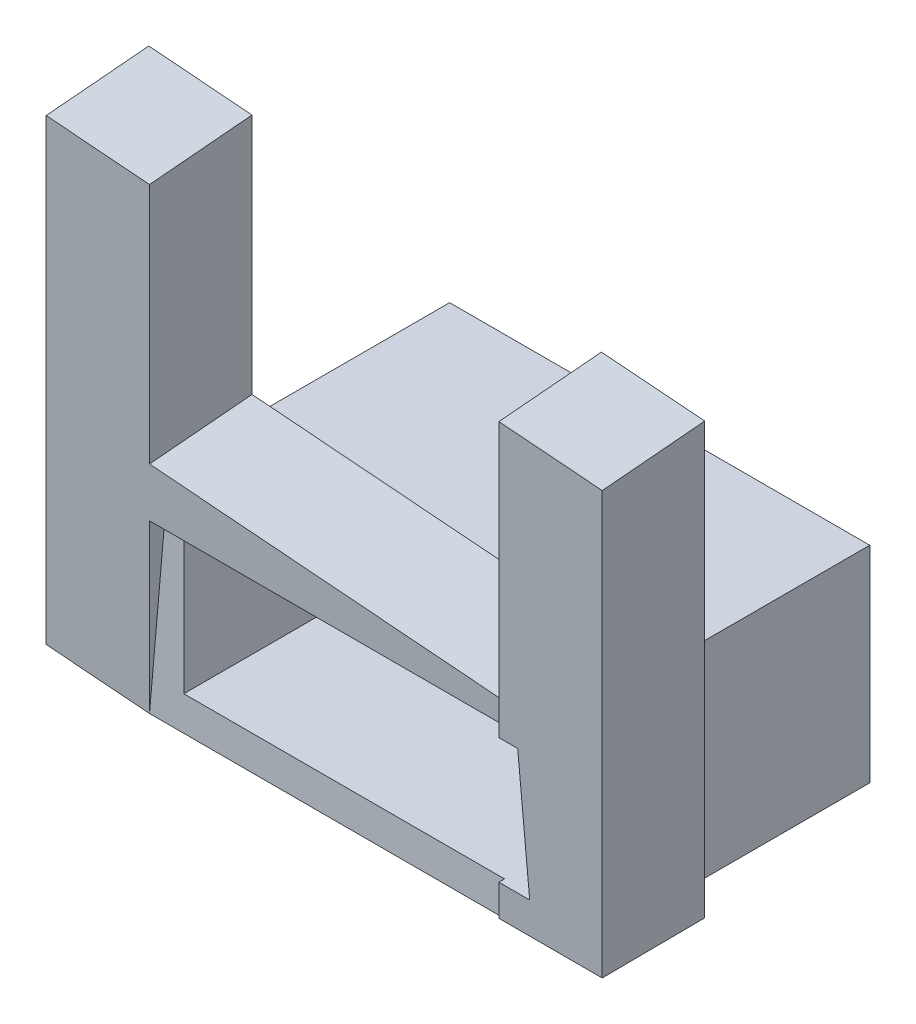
ISO-10303-21;
HEADER;
FILE_DESCRIPTION(('STEP AP214'),'2;1');
FILE_NAME('part.step','',(''),(''),'','','');
FILE_SCHEMA(('AUTOMOTIVE_DESIGN { 1 0 10303 214 1 1 1 1 }'));
ENDSEC;
DATA;
#1=APPLICATION_CONTEXT('core data for automotive mechanical design processes');
#2=APPLICATION_PROTOCOL_DEFINITION('international standard','automotive_design',2000,#1);
#3=PRODUCT_CONTEXT('',#1,'mechanical');
#4=PRODUCT('Part','Part','',(#3));
#5=PRODUCT_RELATED_PRODUCT_CATEGORY('part','',(#4));
#6=PRODUCT_DEFINITION_FORMATION('','',#4);
#7=PRODUCT_DEFINITION_CONTEXT('part definition',#1,'design');
#8=PRODUCT_DEFINITION('design','',#6,#7);
#9=PRODUCT_DEFINITION_SHAPE('','',#8);
#10=(LENGTH_UNIT() NAMED_UNIT(*) SI_UNIT(.MILLI.,.METRE.));
#11=(NAMED_UNIT(*) PLANE_ANGLE_UNIT() SI_UNIT($,.RADIAN.));
#12=(NAMED_UNIT(*) SI_UNIT($,.STERADIAN.) SOLID_ANGLE_UNIT());
#13=UNCERTAINTY_MEASURE_WITH_UNIT(LENGTH_MEASURE(1.E-05),#10,'distance_accuracy_value','');
#14=(GEOMETRIC_REPRESENTATION_CONTEXT(3) GLOBAL_UNCERTAINTY_ASSIGNED_CONTEXT((#13)) GLOBAL_UNIT_ASSIGNED_CONTEXT((#10,
#11,#12)) REPRESENTATION_CONTEXT('',''));
#15=CARTESIAN_POINT('',(0.,0.,0.));
#16=DIRECTION('',(0.,0.,1.));
#17=DIRECTION('',(1.,0.,0.));
#18=AXIS2_PLACEMENT_3D('',#15,#16,#17);
#19=CARTESIAN_POINT('',(-1.85740908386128,22.3757953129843,-10.0882096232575));
#20=DIRECTION('',(0.,-0.996194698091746,-0.0871557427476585));
#21=DIRECTION('',(0.,0.0871557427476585,-0.996194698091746));
#22=AXIS2_PLACEMENT_3D('',#19,#20,#21);
#23=PLANE('',#22);
#24=DIRECTION('',(1.,0.,0.));
#25=VECTOR('',#24,1.);
#26=CARTESIAN_POINT('',(-1.85740908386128,21.4931913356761,0.));
#27=LINE('',#26,#25);
#28=CARTESIAN_POINT('',(1.86612675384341,21.4931913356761,0.));
#29=VERTEX_POINT('',#28);
#30=CARTESIAN_POINT('',(42.9278753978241,21.4931913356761,0.));
#31=VERTEX_POINT('',#30);
#32=EDGE_CURVE('E344',#29,#31,#27,.T.);
#33=ORIENTED_EDGE('',*,*,#32,.T.);
#34=DIRECTION('',(0.,-0.0871557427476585,0.996194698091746));
#35=VECTOR('',#34,1.);
#36=CARTESIAN_POINT('',(42.9278753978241,22.3757953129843,-10.0882096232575));
#37=LINE('',#36,#35);
#38=CARTESIAN_POINT('',(42.9278753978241,21.3299264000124,1.86612675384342));
#39=VERTEX_POINT('',#38);
#40=EDGE_CURVE('E282',#31,#39,#37,.T.);
#41=ORIENTED_EDGE('',*,*,#40,.T.);
#42=DIRECTION('',(1.,0.,0.));
#43=VECTOR('',#42,1.);
#44=CARTESIAN_POINT('',(-1.85740908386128,21.3299264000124,1.86612675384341));
#45=LINE('',#44,#43);
#46=CARTESIAN_POINT('',(1.86612675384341,21.3299264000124,1.86612675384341));
#47=VERTEX_POINT('',#46);
#48=EDGE_CURVE('E348',#47,#39,#45,.T.);
#49=ORIENTED_EDGE('',*,*,#48,.F.);
#50=DIRECTION('',(0.,-0.0871557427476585,0.996194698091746));
#51=VECTOR('',#50,1.);
#52=CARTESIAN_POINT('',(1.86612675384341,21.3299264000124,1.86612675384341));
#53=LINE('',#52,#51);
#54=EDGE_CURVE('E364',#29,#47,#53,.T.);
#55=ORIENTED_EDGE('',*,*,#54,.F.);
#56=EDGE_LOOP('',(#33,#41,#49,#55));
#57=FACE_BOUND('',#56,.T.);
#58=ADVANCED_FACE('F67',(#57),#23,.T.);
#59=CARTESIAN_POINT('',(44.3444251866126,22.3757953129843,-10.0882096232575));
#60=DIRECTION('',(0.904828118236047,0.424156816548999,0.0371089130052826));
#61=DIRECTION('',(-0.424449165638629,0.905451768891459,0.));
#62=AXIS2_PLACEMENT_3D('',#59,#60,#61);
#63=PLANE('',#62);
#64=DIRECTION('',(0.,0.0871557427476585,-0.996194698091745));
#65=VECTOR('',#64,1.);
#66=CARTESIAN_POINT('',(43.1492429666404,24.9060382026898,-9.86684205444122));
#67=LINE('',#66,#65);
#68=CARTESIAN_POINT('',(43.1492429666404,23.8601692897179,2.08749432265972));
#69=VERTEX_POINT('',#68);
#70=CARTESIAN_POINT('',(43.1492429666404,24.8789553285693,-9.55728338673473));
#71=VERTEX_POINT('',#70);
#72=EDGE_CURVE('E286',#69,#71,#67,.T.);
#73=ORIENTED_EDGE('',*,*,#72,.T.);
#74=DIRECTION('',(0.425777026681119,-0.901384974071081,-0.0788609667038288));
#75=VECTOR('',#74,1.);
#76=CARTESIAN_POINT('',(44.3444251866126,22.3487124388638,-9.77865095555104));
#77=LINE('',#76,#75);
#78=CARTESIAN_POINT('',(43.5644251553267,24.,-9.63418201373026));
#79=VERTEX_POINT('',#78);
#80=EDGE_CURVE('E276',#71,#79,#77,.T.);
#81=ORIENTED_EDGE('',*,*,#80,.T.);
#82=DIRECTION('',(0.040977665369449,0.,-0.99916006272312));
#83=VECTOR('',#82,1.);
#84=CARTESIAN_POINT('',(43.5843242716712,24.,-10.1193829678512));
#85=LINE('',#84,#83);
#86=CARTESIAN_POINT('',(43.577217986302,24.,-9.94611012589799));
#87=VERTEX_POINT('',#86);
#88=EDGE_CURVE('E73',#79,#87,#85,.T.);
#89=ORIENTED_EDGE('',*,*,#88,.T.);
#90=DIRECTION('',(-0.425777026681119,0.901384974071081,0.0788609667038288));
#91=VECTOR('',#90,1.);
#92=CARTESIAN_POINT('',(44.3444251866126,22.3757953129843,-10.0882096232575));
#93=LINE('',#92,#91);
#94=CARTESIAN_POINT('',(43.0456461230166,25.1253563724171,-9.84765420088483));
#95=VERTEX_POINT('',#94);
#96=EDGE_CURVE('E352',#87,#95,#93,.T.);
#97=ORIENTED_EDGE('',*,*,#96,.T.);
#98=DIRECTION('',(0.,-0.0871557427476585,0.996194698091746));
#99=VECTOR('',#98,1.);
#100=CARTESIAN_POINT('',(43.0456461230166,25.1253563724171,-9.84765420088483));
#101=LINE('',#100,#99);
#102=CARTESIAN_POINT('',(43.0456461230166,24.0794874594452,2.10668217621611));
#103=VERTEX_POINT('',#102);
#104=EDGE_CURVE('E356',#95,#103,#101,.T.);
#105=ORIENTED_EDGE('',*,*,#104,.T.);
#106=DIRECTION('',(-0.425777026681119,0.901384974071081,0.0788609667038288));
#107=VECTOR('',#106,1.);
#108=CARTESIAN_POINT('',(44.3444251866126,21.3299264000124,1.86612675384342));
#109=LINE('',#108,#107);
#110=EDGE_CURVE('E358',#69,#103,#109,.T.);
#111=ORIENTED_EDGE('',*,*,#110,.F.);
#112=EDGE_LOOP('',(#73,#81,#89,#97,#105,#111));
#113=FACE_BOUND('',#112,.T.);
#114=ADVANCED_FACE('F451',(#113),#63,.T.);
#115=CARTESIAN_POINT('',(-6.83191224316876,59.5914723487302,5.21357827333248));
#116=DIRECTION('',(0.,0.0871557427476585,-0.996194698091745));
#117=DIRECTION('',(0.,0.996194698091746,0.0871557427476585));
#118=AXIS2_PLACEMENT_3D('',#115,#116,#117);
#119=PLANE('',#118);
#120=DIRECTION('',(-0.0868265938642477,-0.992432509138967,-0.0868265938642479));
#121=VECTOR('',#120,1.);
#122=CARTESIAN_POINT('',(45.8749590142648,55.0152462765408,4.81321037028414));
#123=LINE('',#122,#121);
#124=EDGE_CURVE('E281',#69,#39,#123,.T.);
#125=ORIENTED_EDGE('',*,*,#124,.F.);
#126=ORIENTED_EDGE('',*,*,#110,.T.);
#127=DIRECTION('',(-0.996194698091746,0.0868240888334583,0.00759612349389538));
#128=VECTOR('',#127,1.);
#129=CARTESIAN_POINT('',(43.0456461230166,24.0794874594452,2.10668217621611));
#130=LINE('',#129,#128);
#131=CARTESIAN_POINT('',(2.41648519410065,27.6205521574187,2.41648519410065));
#132=VERTEX_POINT('',#131);
#133=EDGE_CURVE('E351',#103,#132,#130,.T.);
#134=ORIENTED_EDGE('',*,*,#133,.T.);
#135=DIRECTION('',(-0.0868265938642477,-0.992432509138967,-0.0868265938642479));
#136=VECTOR('',#135,1.);
#137=CARTESIAN_POINT('',(5.12276903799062,58.5535180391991,5.12276903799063));
#138=LINE('',#137,#136);
#139=CARTESIAN_POINT('',(5.12276903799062,58.5535180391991,5.12276903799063));
#140=VERTEX_POINT('',#139);
#141=EDGE_CURVE('E399',#140,#132,#138,.T.);
#142=ORIENTED_EDGE('',*,*,#141,.F.);
#143=DIRECTION('',(0.996223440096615,-0.0864961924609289,-0.00756743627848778));
#144=VECTOR('',#143,1.);
#145=CARTESIAN_POINT('',(-6.83191224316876,59.5914723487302,5.21357827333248));
#146=LINE('',#145,#144);
#147=CARTESIAN_POINT('',(-6.83191224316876,59.5914723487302,5.21357827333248));
#148=VERTEX_POINT('',#147);
#149=EDGE_CURVE('E371',#148,#140,#146,.T.);
#150=ORIENTED_EDGE('',*,*,#149,.F.);
#151=DIRECTION('',(-0.0868265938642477,-0.992432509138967,-0.0868265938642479));
#152=VECTOR('',#151,1.);
#153=CARTESIAN_POINT('',(-6.83191224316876,59.5914723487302,5.21357827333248));
#154=LINE('',#153,#152);
#155=CARTESIAN_POINT('',(-11.9546812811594,1.03795430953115,0.0908092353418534));
#156=VERTEX_POINT('',#155);
#157=EDGE_CURVE('E381',#148,#156,#154,.T.);
#158=ORIENTED_EDGE('',*,*,#157,.T.);
#159=DIRECTION('',(0.996223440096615,-0.0864961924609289,-0.00756743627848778));
#160=VECTOR('',#159,1.);
#161=CARTESIAN_POINT('',(-11.9546812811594,1.03795430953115,0.0908092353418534));
#162=LINE('',#161,#160);
#163=CARTESIAN_POINT('',(0.,0.,0.));
#164=VERTEX_POINT('',#163);
#165=EDGE_CURVE('E367',#156,#164,#162,.T.);
#166=ORIENTED_EDGE('',*,*,#165,.T.);
#167=EDGE_CURVE('E397',#47,#164,#138,.T.);
#168=ORIENTED_EDGE('',*,*,#167,.F.);
#169=ORIENTED_EDGE('',*,*,#48,.T.);
#170=EDGE_LOOP('',(#125,#126,#134,#142,#150,#158,#166,#168,#169));
#171=FACE_BOUND('',#170,.T.);
#172=ADVANCED_FACE('F68',(#171),#119,.F.);
#173=CARTESIAN_POINT('',(0.,0.,0.));
#174=DIRECTION('',(0.,0.,-1.));
#175=DIRECTION('',(-1.,0.,0.));
#176=AXIS2_PLACEMENT_3D('',#173,#174,#175);
#177=PLANE('',#176);
#178=DIRECTION('',(-0.0864986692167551,-0.996251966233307,0.));
#179=VECTOR('',#178,1.);
#180=CARTESIAN_POINT('',(40.7545238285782,-3.53847439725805,0.));
#181=LINE('',#180,#179);
#182=CARTESIAN_POINT('',(42.79823042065,20.,0.));
#183=VERTEX_POINT('',#182);
#184=EDGE_CURVE('E12',#31,#183,#181,.T.);
#185=ORIENTED_EDGE('',*,*,#184,.F.);
#186=ORIENTED_EDGE('',*,*,#32,.F.);
#187=DIRECTION('',(-0.0864986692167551,-0.996251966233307,0.));
#188=VECTOR('',#187,1.);
#189=CARTESIAN_POINT('',(5.08414700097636,58.5568713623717,0.));
#190=LINE('',#189,#188);
#191=EDGE_CURVE('E347',#29,#164,#190,.T.);
#192=ORIENTED_EDGE('',*,*,#191,.T.);
#193=DIRECTION('',(1.,0.,0.));
#194=VECTOR('',#193,1.);
#195=CARTESIAN_POINT('',(0.,0.,0.));
#196=LINE('',#195,#194);
#197=CARTESIAN_POINT('',(41.0617486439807,0.,0.));
#198=VERTEX_POINT('',#197);
#199=EDGE_CURVE('E318',#164,#198,#196,.T.);
#200=ORIENTED_EDGE('',*,*,#199,.T.);
#201=DIRECTION('',(-0.0864986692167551,-0.996251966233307,0.));
#202=VECTOR('',#201,1.);
#203=CARTESIAN_POINT('',(40.7545238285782,-3.53847439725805,0.));
#204=LINE('',#203,#202);
#205=CARTESIAN_POINT('',(41.4090449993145,4.,0.));
#206=VERTEX_POINT('',#205);
#207=EDGE_CURVE('E272',#206,#198,#204,.T.);
#208=ORIENTED_EDGE('',*,*,#207,.F.);
#209=DIRECTION('',(1.,0.,0.));
#210=VECTOR('',#209,1.);
#211=CARTESIAN_POINT('',(4.,4.,0.));
#212=LINE('',#211,#210);
#213=CARTESIAN_POINT('',(4.,4.,0.));
#214=VERTEX_POINT('',#213);
#215=EDGE_CURVE('E291',#214,#206,#212,.T.);
#216=ORIENTED_EDGE('',*,*,#215,.F.);
#217=DIRECTION('',(0.,1.,0.));
#218=VECTOR('',#217,1.);
#219=CARTESIAN_POINT('',(4.,4.,0.));
#220=LINE('',#219,#218);
#221=CARTESIAN_POINT('',(4.,20.,0.));
#222=VERTEX_POINT('',#221);
#223=EDGE_CURVE('E288',#214,#222,#220,.T.);
#224=ORIENTED_EDGE('',*,*,#223,.T.);
#225=DIRECTION('',(1.,0.,0.));
#226=VECTOR('',#225,1.);
#227=CARTESIAN_POINT('',(4.,20.,0.));
#228=LINE('',#227,#226);
#229=EDGE_CURVE('E303',#222,#183,#228,.T.);
#230=ORIENTED_EDGE('',*,*,#229,.T.);
#231=EDGE_LOOP('',(#185,#186,#192,#200,#208,#216,#224,#230));
#232=FACE_BOUND('',#231,.T.);
#233=ADVANCED_FACE('F447',(#232),#177,.F.);
#234=CARTESIAN_POINT('',(0.,24.,-35.));
#235=DIRECTION('',(0.,-1.,0.));
#236=DIRECTION('',(0.,0.,-1.));
#237=AXIS2_PLACEMENT_3D('',#234,#235,#236);
#238=PLANE('',#237);
#239=DIRECTION('',(-1.,0.,0.));
#240=VECTOR('',#239,1.);
#241=CARTESIAN_POINT('',(0.,24.,-9.63418201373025));
#242=LINE('',#241,#240);
#243=CARTESIAN_POINT('',(49.,24.,-9.63418201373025));
#244=VERTEX_POINT('',#243);
#245=EDGE_CURVE('E280',#244,#79,#242,.T.);
#246=ORIENTED_EDGE('',*,*,#245,.F.);
#247=DIRECTION('',(0.,0.,1.));
#248=VECTOR('',#247,1.);
#249=CARTESIAN_POINT('',(49.,24.,-35.));
#250=LINE('',#249,#248);
#251=CARTESIAN_POINT('',(49.,24.,-35.));
#252=VERTEX_POINT('',#251);
#253=EDGE_CURVE('E333',#252,#244,#250,.T.);
#254=ORIENTED_EDGE('',*,*,#253,.F.);
#255=DIRECTION('',(1.,0.,0.));
#256=VECTOR('',#255,1.);
#257=CARTESIAN_POINT('',(0.,24.,-35.));
#258=LINE('',#257,#256);
#259=CARTESIAN_POINT('',(0.,24.,-35.));
#260=VERTEX_POINT('',#259);
#261=EDGE_CURVE('E325',#260,#252,#258,.T.);
#262=ORIENTED_EDGE('',*,*,#261,.F.);
#263=DIRECTION('',(0.,0.,1.));
#264=VECTOR('',#263,1.);
#265=CARTESIAN_POINT('',(0.,24.,-35.));
#266=LINE('',#265,#264);
#267=CARTESIAN_POINT('',(0.,24.,-9.94611012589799));
#268=VERTEX_POINT('',#267);
#269=EDGE_CURVE('E339',#260,#268,#266,.T.);
#270=ORIENTED_EDGE('',*,*,#269,.T.);
#271=DIRECTION('',(1.,0.,0.));
#272=VECTOR('',#271,1.);
#273=CARTESIAN_POINT('',(5.12276903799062,24.,-9.94611012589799));
#274=LINE('',#273,#272);
#275=EDGE_CURVE('E341',#268,#87,#274,.T.);
#276=ORIENTED_EDGE('',*,*,#275,.T.);
#277=ORIENTED_EDGE('',*,*,#88,.F.);
#278=EDGE_LOOP('',(#246,#254,#262,#270,#276,#277));
#279=FACE_BOUND('',#278,.T.);
#280=ADVANCED_FACE('F434',(#279),#238,.F.);
#281=CARTESIAN_POINT('',(49.,0.,-35.));
#282=DIRECTION('',(1.,0.,0.));
#283=DIRECTION('',(0.,0.,-1.));
#284=AXIS2_PLACEMENT_3D('',#281,#282,#283);
#285=PLANE('',#284);
#286=ORIENTED_EDGE('',*,*,#253,.T.);
#287=DIRECTION('',(0.,-0.996194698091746,-0.0871557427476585));
#288=VECTOR('',#287,1.);
#289=CARTESIAN_POINT('',(49.,-2.0200570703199,-11.9106420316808));
#290=LINE('',#289,#288);
#291=CARTESIAN_POINT('',(49.,0.,-11.7339099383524));
#292=VERTEX_POINT('',#291);
#293=EDGE_CURVE('E274',#244,#292,#290,.T.);
#294=ORIENTED_EDGE('',*,*,#293,.T.);
#295=DIRECTION('',(0.,0.,1.));
#296=VECTOR('',#295,1.);
#297=CARTESIAN_POINT('',(49.,0.,-35.));
#298=LINE('',#297,#296);
#299=CARTESIAN_POINT('',(49.,0.,-35.));
#300=VERTEX_POINT('',#299);
#301=EDGE_CURVE('E228',#300,#292,#298,.T.);
#302=ORIENTED_EDGE('',*,*,#301,.F.);
#303=DIRECTION('',(0.,1.,0.));
#304=VECTOR('',#303,1.);
#305=CARTESIAN_POINT('',(49.,0.,-35.));
#306=LINE('',#305,#304);
#307=EDGE_CURVE('E322',#300,#252,#306,.T.);
#308=ORIENTED_EDGE('',*,*,#307,.T.);
#309=EDGE_LOOP('',(#286,#294,#302,#308));
#310=FACE_BOUND('',#309,.T.);
#311=ADVANCED_FACE('F485',(#310),#285,.T.);
#312=CARTESIAN_POINT('',(5.12276903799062,58.5535180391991,5.12276903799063));
#313=DIRECTION('',(-0.996223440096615,0.0864961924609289,0.00756743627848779));
#314=DIRECTION('',(-0.0864986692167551,-0.996251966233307,0.));
#315=AXIS2_PLACEMENT_3D('',#312,#313,#314);
#316=PLANE('',#315);
#317=ORIENTED_EDGE('',*,*,#191,.F.);
#318=ORIENTED_EDGE('',*,*,#54,.T.);
#319=ORIENTED_EDGE('',*,*,#167,.T.);
#320=EDGE_LOOP('',(#317,#318,#319));
#321=FACE_BOUND('',#320,.T.);
#322=ADVANCED_FACE('F410',(#321),#316,.F.);
#323=CARTESIAN_POINT('',(5.12276903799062,59.599386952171,-6.83156733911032));
#324=DIRECTION('',(0.,-0.0871557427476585,0.996194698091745));
#325=DIRECTION('',(0.,-0.996194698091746,-0.0871557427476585));
#326=AXIS2_PLACEMENT_3D('',#323,#324,#325);
#327=PLANE('',#326);
#328=DIRECTION('',(0.,0.996194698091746,0.0871557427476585));
#329=VECTOR('',#328,1.);
#330=CARTESIAN_POINT('',(0.,59.599386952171,-6.83156733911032));
#331=LINE('',#330,#329);
#332=CARTESIAN_POINT('',(0.,1.0458689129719,-11.9543363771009));
#333=VERTEX_POINT('',#332);
#334=EDGE_CURVE('E346',#333,#268,#331,.T.);
#335=ORIENTED_EDGE('',*,*,#334,.F.);
#336=DIRECTION('',(-0.996223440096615,0.0864961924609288,0.00756743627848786));
#337=VECTOR('',#336,1.);
#338=CARTESIAN_POINT('',(0.,1.0458689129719,-11.9543363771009));
#339=LINE('',#338,#337);
#340=CARTESIAN_POINT('',(-11.9546812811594,2.08382322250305,-11.8635271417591));
#341=VERTEX_POINT('',#340);
#342=EDGE_CURVE('E387',#333,#341,#339,.T.);
#343=ORIENTED_EDGE('',*,*,#342,.T.);
#344=DIRECTION('',(-0.0868265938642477,-0.992432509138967,-0.0868265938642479));
#345=VECTOR('',#344,1.);
#346=CARTESIAN_POINT('',(-6.83191224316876,60.6373412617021,-6.74075810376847));
#347=LINE('',#346,#345);
#348=CARTESIAN_POINT('',(-6.83191224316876,60.6373412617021,-6.74075810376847));
#349=VERTEX_POINT('',#348);
#350=EDGE_CURVE('E392',#349,#341,#347,.T.);
#351=ORIENTED_EDGE('',*,*,#350,.F.);
#352=DIRECTION('',(-0.996223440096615,0.0864961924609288,0.00756743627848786));
#353=VECTOR('',#352,1.);
#354=CARTESIAN_POINT('',(5.12276903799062,59.599386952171,-6.83156733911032));
#355=LINE('',#354,#353);
#356=CARTESIAN_POINT('',(5.12276903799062,59.599386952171,-6.83156733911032));
#357=VERTEX_POINT('',#356);
#358=EDGE_CURVE('E380',#357,#349,#355,.T.);
#359=ORIENTED_EDGE('',*,*,#358,.F.);
#360=DIRECTION('',(-0.0868265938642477,-0.992432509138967,-0.0868265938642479));
#361=VECTOR('',#360,1.);
#362=CARTESIAN_POINT('',(5.12276903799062,59.599386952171,-6.83156733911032));
#363=LINE('',#362,#361);
#364=CARTESIAN_POINT('',(2.41648519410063,28.6664210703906,-9.5378511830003));
#365=VERTEX_POINT('',#364);
#366=EDGE_CURVE('E391',#357,#365,#363,.T.);
#367=ORIENTED_EDGE('',*,*,#366,.T.);
#368=DIRECTION('',(-0.996194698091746,0.0868240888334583,0.00759612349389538));
#369=VECTOR('',#368,1.);
#370=CARTESIAN_POINT('',(43.0456461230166,25.1253563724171,-9.84765420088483));
#371=LINE('',#370,#369);
#372=EDGE_CURVE('E354',#95,#365,#371,.T.);
#373=ORIENTED_EDGE('',*,*,#372,.F.);
#374=ORIENTED_EDGE('',*,*,#96,.F.);
#375=ORIENTED_EDGE('',*,*,#275,.F.);
#376=EDGE_LOOP('',(#335,#343,#351,#359,#367,#373,#374,#375));
#377=FACE_BOUND('',#376,.T.);
#378=ADVANCED_FACE('F430',(#377),#327,.F.);
#379=ORIENTED_EDGE('',*,*,#141,.T.);
#380=DIRECTION('',(0.,0.0871557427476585,-0.996194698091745));
#381=VECTOR('',#380,1.);
#382=CARTESIAN_POINT('',(2.41648519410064,27.6205521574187,2.41648519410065));
#383=LINE('',#382,#381);
#384=EDGE_CURVE('E370',#132,#365,#383,.T.);
#385=ORIENTED_EDGE('',*,*,#384,.T.);
#386=ORIENTED_EDGE('',*,*,#366,.F.);
#387=DIRECTION('',(0.,0.0871557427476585,-0.996194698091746));
#388=VECTOR('',#387,1.);
#389=CARTESIAN_POINT('',(5.12276903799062,58.5535180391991,5.12276903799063));
#390=LINE('',#389,#388);
#391=EDGE_CURVE('E372',#140,#357,#390,.T.);
#392=ORIENTED_EDGE('',*,*,#391,.F.);
#393=EDGE_LOOP('',(#379,#385,#386,#392));
#394=FACE_BOUND('',#393,.T.);
#395=ADVANCED_FACE('F456',(#394),#316,.F.);
#396=CARTESIAN_POINT('',(-6.83191224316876,60.6373412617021,-6.74075810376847));
#397=DIRECTION('',(0.996223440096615,-0.0864961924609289,-0.0075674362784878));
#398=DIRECTION('',(0.0864986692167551,0.996251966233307,0.));
#399=AXIS2_PLACEMENT_3D('',#396,#397,#398);
#400=PLANE('',#399);
#401=DIRECTION('',(0.,-0.0871557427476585,0.996194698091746));
#402=VECTOR('',#401,1.);
#403=CARTESIAN_POINT('',(-11.9546812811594,2.08382322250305,-11.8635271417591));
#404=LINE('',#403,#402);
#405=EDGE_CURVE('E374',#341,#156,#404,.T.);
#406=ORIENTED_EDGE('',*,*,#405,.T.);
#407=ORIENTED_EDGE('',*,*,#157,.F.);
#408=DIRECTION('',(0.,-0.0871557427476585,0.996194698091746));
#409=VECTOR('',#408,1.);
#410=CARTESIAN_POINT('',(-6.83191224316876,60.6373412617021,-6.74075810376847));
#411=LINE('',#410,#409);
#412=EDGE_CURVE('E377',#349,#148,#411,.T.);
#413=ORIENTED_EDGE('',*,*,#412,.F.);
#414=ORIENTED_EDGE('',*,*,#350,.T.);
#415=EDGE_LOOP('',(#406,#407,#413,#414));
#416=FACE_BOUND('',#415,.T.);
#417=ADVANCED_FACE('F421',(#416),#400,.F.);
#418=CARTESIAN_POINT('',(5.12276903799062,58.5535180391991,5.12276903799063));
#419=DIRECTION('',(0.0868265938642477,0.992432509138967,0.0868265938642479));
#420=DIRECTION('',(0.,-0.0871557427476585,0.996194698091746));
#421=AXIS2_PLACEMENT_3D('',#418,#419,#420);
#422=PLANE('',#421);
#423=ORIENTED_EDGE('',*,*,#149,.T.);
#424=ORIENTED_EDGE('',*,*,#391,.T.);
#425=ORIENTED_EDGE('',*,*,#358,.T.);
#426=ORIENTED_EDGE('',*,*,#412,.T.);
#427=EDGE_LOOP('',(#423,#424,#425,#426));
#428=FACE_BOUND('',#427,.T.);
#429=ADVANCED_FACE('F458',(#428),#422,.T.);
#430=CARTESIAN_POINT('',(0.,0.,0.));
#431=DIRECTION('',(0.0868265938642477,0.992432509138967,0.0868265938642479));
#432=DIRECTION('',(0.,-0.0871557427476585,0.996194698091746));
#433=AXIS2_PLACEMENT_3D('',#430,#431,#432);
#434=PLANE('',#433);
#435=ORIENTED_EDGE('',*,*,#165,.F.);
#436=ORIENTED_EDGE('',*,*,#405,.F.);
#437=ORIENTED_EDGE('',*,*,#342,.F.);
#438=DIRECTION('',(0.,0.0871557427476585,-0.996194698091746));
#439=VECTOR('',#438,1.);
#440=CARTESIAN_POINT('',(0.,0.,0.));
#441=LINE('',#440,#439);
#442=EDGE_CURVE('E383',#164,#333,#441,.T.);
#443=ORIENTED_EDGE('',*,*,#442,.F.);
#444=EDGE_LOOP('',(#435,#436,#437,#443));
#445=FACE_BOUND('',#444,.T.);
#446=ADVANCED_FACE('F413',(#445),#434,.F.);
#447=CARTESIAN_POINT('',(43.0456461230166,25.1253563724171,-9.84765420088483));
#448=DIRECTION('',(0.0871557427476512,0.992403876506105,0.0868240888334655));
#449=DIRECTION('',(-0.996165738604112,0.0874861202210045,0.));
#450=AXIS2_PLACEMENT_3D('',#447,#448,#449);
#451=PLANE('',#450);
#452=ORIENTED_EDGE('',*,*,#384,.F.);
#453=ORIENTED_EDGE('',*,*,#133,.F.);
#454=ORIENTED_EDGE('',*,*,#104,.F.);
#455=ORIENTED_EDGE('',*,*,#372,.T.);
#456=EDGE_LOOP('',(#452,#453,#454,#455));
#457=FACE_BOUND('',#456,.T.);
#458=ADVANCED_FACE('F457',(#457),#451,.T.);
#459=CARTESIAN_POINT('',(0.,0.,-35.));
#460=DIRECTION('',(1.,0.,0.));
#461=DIRECTION('',(0.,0.,-1.));
#462=AXIS2_PLACEMENT_3D('',#459,#460,#461);
#463=PLANE('',#462);
#464=ORIENTED_EDGE('',*,*,#442,.T.);
#465=ORIENTED_EDGE('',*,*,#334,.T.);
#466=ORIENTED_EDGE('',*,*,#269,.F.);
#467=DIRECTION('',(0.,1.,0.));
#468=VECTOR('',#467,1.);
#469=CARTESIAN_POINT('',(0.,0.,-35.));
#470=LINE('',#469,#468);
#471=CARTESIAN_POINT('',(0.,0.,-35.));
#472=VERTEX_POINT('',#471);
#473=EDGE_CURVE('E317',#472,#260,#470,.T.);
#474=ORIENTED_EDGE('',*,*,#473,.F.);
#475=DIRECTION('',(0.,0.,1.));
#476=VECTOR('',#475,1.);
#477=CARTESIAN_POINT('',(0.,0.,-35.));
#478=LINE('',#477,#476);
#479=EDGE_CURVE('E328',#472,#164,#478,.T.);
#480=ORIENTED_EDGE('',*,*,#479,.T.);
#481=EDGE_LOOP('',(#464,#465,#466,#474,#480));
#482=FACE_BOUND('',#481,.T.);
#483=ADVANCED_FACE('F431',(#482),#463,.F.);
#484=CARTESIAN_POINT('',(0.,0.,-35.));
#485=DIRECTION('',(0.,0.,-1.));
#486=DIRECTION('',(-1.,0.,0.));
#487=AXIS2_PLACEMENT_3D('',#484,#485,#486);
#488=PLANE('',#487);
#489=ORIENTED_EDGE('',*,*,#473,.T.);
#490=ORIENTED_EDGE('',*,*,#261,.T.);
#491=ORIENTED_EDGE('',*,*,#307,.F.);
#492=DIRECTION('',(1.,0.,0.));
#493=VECTOR('',#492,1.);
#494=CARTESIAN_POINT('',(0.,0.,-35.));
#495=LINE('',#494,#493);
#496=EDGE_CURVE('E330',#472,#300,#495,.T.);
#497=ORIENTED_EDGE('',*,*,#496,.F.);
#498=EDGE_LOOP('',(#489,#490,#491,#497));
#499=FACE_BOUND('',#498,.T.);
#500=DIRECTION('',(1.,0.,0.));
#501=VECTOR('',#500,1.);
#502=CARTESIAN_POINT('',(4.,20.,-35.));
#503=LINE('',#502,#501);
#504=CARTESIAN_POINT('',(4.,20.,-35.));
#505=VERTEX_POINT('',#504);
#506=CARTESIAN_POINT('',(45.,20.,-35.));
#507=VERTEX_POINT('',#506);
#508=EDGE_CURVE('E295',#505,#507,#503,.T.);
#509=ORIENTED_EDGE('',*,*,#508,.F.);
#510=DIRECTION('',(0.,1.,0.));
#511=VECTOR('',#510,1.);
#512=CARTESIAN_POINT('',(4.,4.,-35.));
#513=LINE('',#512,#511);
#514=CARTESIAN_POINT('',(4.,4.,-35.));
#515=VERTEX_POINT('',#514);
#516=EDGE_CURVE('E290',#515,#505,#513,.T.);
#517=ORIENTED_EDGE('',*,*,#516,.F.);
#518=DIRECTION('',(1.,0.,0.));
#519=VECTOR('',#518,1.);
#520=CARTESIAN_POINT('',(4.,4.,-35.));
#521=LINE('',#520,#519);
#522=CARTESIAN_POINT('',(45.,4.,-35.));
#523=VERTEX_POINT('',#522);
#524=EDGE_CURVE('E299',#515,#523,#521,.T.);
#525=ORIENTED_EDGE('',*,*,#524,.T.);
#526=DIRECTION('',(0.,1.,0.));
#527=VECTOR('',#526,1.);
#528=CARTESIAN_POINT('',(45.,4.,-35.));
#529=LINE('',#528,#527);
#530=EDGE_CURVE('E293',#523,#507,#529,.T.);
#531=ORIENTED_EDGE('',*,*,#530,.T.);
#532=EDGE_LOOP('',(#509,#517,#525,#531));
#533=FACE_BOUND('',#532,.T.);
#534=ADVANCED_FACE('F439',(#499,#533),#488,.T.);
#535=CARTESIAN_POINT('',(0.,0.,-35.));
#536=DIRECTION('',(0.,-1.,0.));
#537=DIRECTION('',(0.,0.,-1.));
#538=AXIS2_PLACEMENT_3D('',#535,#536,#537);
#539=PLANE('',#538);
#540=DIRECTION('',(0.00759590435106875,0.,0.999971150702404));
#541=VECTOR('',#540,1.);
#542=CARTESIAN_POINT('',(41.1009372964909,0.,5.15903309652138));
#543=LINE('',#542,#541);
#544=CARTESIAN_POINT('',(41.0641180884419,0.,0.311928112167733));
#545=VERTEX_POINT('',#544);
#546=EDGE_CURVE('E271',#198,#545,#543,.T.);
#547=ORIENTED_EDGE('',*,*,#546,.F.);
#548=ORIENTED_EDGE('',*,*,#199,.F.);
#549=ORIENTED_EDGE('',*,*,#479,.F.);
#550=ORIENTED_EDGE('',*,*,#496,.T.);
#551=ORIENTED_EDGE('',*,*,#301,.T.);
#552=DIRECTION('',(-1.,0.,0.));
#553=VECTOR('',#552,1.);
#554=CARTESIAN_POINT('',(45.8749590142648,0.,-11.7339099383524));
#555=LINE('',#554,#553);
#556=CARTESIAN_POINT('',(53.0181069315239,0.,-11.7339099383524));
#557=VERTEX_POINT('',#556);
#558=EDGE_CURVE('E82',#557,#292,#555,.T.);
#559=ORIENTED_EDGE('',*,*,#558,.F.);
#560=DIRECTION('',(-0.00759590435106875,0.,-0.999971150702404));
#561=VECTOR('',#560,1.);
#562=CARTESIAN_POINT('',(53.0549314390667,0.,-6.88610729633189));
#563=LINE('',#562,#561);
#564=CARTESIAN_POINT('',(53.1096086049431,0.,0.311928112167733));
#565=VERTEX_POINT('',#564);
#566=EDGE_CURVE('E230',#565,#557,#563,.T.);
#567=ORIENTED_EDGE('',*,*,#566,.F.);
#568=DIRECTION('',(1.,0.,0.));
#569=VECTOR('',#568,1.);
#570=CARTESIAN_POINT('',(57.8296402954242,0.,0.311928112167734));
#571=LINE('',#570,#569);
#572=EDGE_CURVE('E231',#545,#565,#571,.T.);
#573=ORIENTED_EDGE('',*,*,#572,.F.);
#574=EDGE_LOOP('',(#547,#548,#549,#550,#551,#559,#567,#573));
#575=FACE_BOUND('',#574,.T.);
#576=ADVANCED_FACE('F223',(#575),#539,.T.);
#577=CARTESIAN_POINT('',(4.,4.,-35.));
#578=DIRECTION('',(1.,0.,0.));
#579=DIRECTION('',(0.,0.,-1.));
#580=AXIS2_PLACEMENT_3D('',#577,#578,#579);
#581=PLANE('',#580);
#582=ORIENTED_EDGE('',*,*,#223,.F.);
#583=DIRECTION('',(0.,0.,1.));
#584=VECTOR('',#583,1.);
#585=CARTESIAN_POINT('',(4.,4.,-35.));
#586=LINE('',#585,#584);
#587=EDGE_CURVE('E301',#515,#214,#586,.T.);
#588=ORIENTED_EDGE('',*,*,#587,.F.);
#589=ORIENTED_EDGE('',*,*,#516,.T.);
#590=DIRECTION('',(0.,0.,1.));
#591=VECTOR('',#590,1.);
#592=CARTESIAN_POINT('',(4.,20.,-35.));
#593=LINE('',#592,#591);
#594=EDGE_CURVE('E312',#505,#222,#593,.T.);
#595=ORIENTED_EDGE('',*,*,#594,.T.);
#596=EDGE_LOOP('',(#582,#588,#589,#595));
#597=FACE_BOUND('',#596,.T.);
#598=ADVANCED_FACE('F488',(#597),#581,.T.);
#599=CARTESIAN_POINT('',(4.,20.,-35.));
#600=DIRECTION('',(0.,-1.,0.));
#601=DIRECTION('',(0.,0.,-1.));
#602=AXIS2_PLACEMENT_3D('',#599,#600,#601);
#603=PLANE('',#602);
#604=DIRECTION('',(-0.00759590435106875,0.,-0.999971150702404));
#605=VECTOR('',#604,1.);
#606=CARTESIAN_POINT('',(42.8373188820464,20.,5.14584332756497));
#607=LINE('',#606,#605);
#608=CARTESIAN_POINT('',(42.8138913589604,20.,2.06170138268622));
#609=VERTEX_POINT('',#608);
#610=EDGE_CURVE('E268',#609,#183,#607,.T.);
#611=ORIENTED_EDGE('',*,*,#610,.T.);
#612=ORIENTED_EDGE('',*,*,#229,.F.);
#613=ORIENTED_EDGE('',*,*,#594,.F.);
#614=ORIENTED_EDGE('',*,*,#508,.T.);
#615=DIRECTION('',(0.,0.,1.));
#616=VECTOR('',#615,1.);
#617=CARTESIAN_POINT('',(45.,20.,-35.));
#618=LINE('',#617,#616);
#619=CARTESIAN_POINT('',(45.,20.,2.06170138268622));
#620=VERTEX_POINT('',#619);
#621=EDGE_CURVE('E311',#507,#620,#618,.T.);
#622=ORIENTED_EDGE('',*,*,#621,.T.);
#623=DIRECTION('',(-1.,0.,0.));
#624=VECTOR('',#623,1.);
#625=CARTESIAN_POINT('',(57.8296402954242,20.,2.06170138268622));
#626=LINE('',#625,#624);
#627=EDGE_CURVE('E534',#620,#609,#626,.T.);
#628=ORIENTED_EDGE('',*,*,#627,.T.);
#629=EDGE_LOOP('',(#611,#612,#613,#614,#622,#628));
#630=FACE_BOUND('',#629,.T.);
#631=ADVANCED_FACE('F494',(#630),#603,.T.);
#632=CARTESIAN_POINT('',(45.,4.,-35.));
#633=DIRECTION('',(1.,0.,0.));
#634=DIRECTION('',(0.,0.,-1.));
#635=AXIS2_PLACEMENT_3D('',#632,#633,#634);
#636=PLANE('',#635);
#637=DIRECTION('',(0.,-0.996194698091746,-0.0871557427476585));
#638=VECTOR('',#637,1.);
#639=CARTESIAN_POINT('',(45.,53.9502090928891,5.03195980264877));
#640=LINE('',#639,#638);
#641=CARTESIAN_POINT('',(45.,4.,0.661882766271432));
#642=VERTEX_POINT('',#641);
#643=EDGE_CURVE('E253',#620,#642,#640,.T.);
#644=ORIENTED_EDGE('',*,*,#643,.F.);
#645=ORIENTED_EDGE('',*,*,#621,.F.);
#646=ORIENTED_EDGE('',*,*,#530,.F.);
#647=DIRECTION('',(0.,0.,1.));
#648=VECTOR('',#647,1.);
#649=CARTESIAN_POINT('',(45.,4.,-35.));
#650=LINE('',#649,#648);
#651=EDGE_CURVE('E313',#523,#642,#650,.T.);
#652=ORIENTED_EDGE('',*,*,#651,.T.);
#653=EDGE_LOOP('',(#644,#645,#646,#652));
#654=FACE_BOUND('',#653,.T.);
#655=ADVANCED_FACE('F496',(#654),#636,.F.);
#656=CARTESIAN_POINT('',(4.,4.,-35.));
#657=DIRECTION('',(0.,-1.,0.));
#658=DIRECTION('',(0.,0.,-1.));
#659=AXIS2_PLACEMENT_3D('',#656,#657,#658);
#660=PLANE('',#659);
#661=ORIENTED_EDGE('',*,*,#215,.T.);
#662=DIRECTION('',(-0.00759590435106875,0.,-0.999971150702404));
#663=VECTOR('',#662,1.);
#664=CARTESIAN_POINT('',(41.448213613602,4.,5.1563951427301));
#665=LINE('',#664,#663);
#666=CARTESIAN_POINT('',(41.4140727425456,4.,0.661882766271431));
#667=VERTEX_POINT('',#666);
#668=EDGE_CURVE('E266',#667,#206,#665,.T.);
#669=ORIENTED_EDGE('',*,*,#668,.F.);
#670=DIRECTION('',(-1.,0.,0.));
#671=VECTOR('',#670,1.);
#672=CARTESIAN_POINT('',(57.8296402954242,4.,0.661882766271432));
#673=LINE('',#672,#671);
#674=EDGE_CURVE('E242',#642,#667,#673,.T.);
#675=ORIENTED_EDGE('',*,*,#674,.F.);
#676=ORIENTED_EDGE('',*,*,#651,.F.);
#677=ORIENTED_EDGE('',*,*,#524,.F.);
#678=ORIENTED_EDGE('',*,*,#587,.T.);
#679=EDGE_LOOP('',(#661,#669,#675,#676,#677,#678));
#680=FACE_BOUND('',#679,.T.);
#681=ADVANCED_FACE('F504',(#680),#660,.F.);
#682=CARTESIAN_POINT('',(45.8749590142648,54.9881634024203,5.12276903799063));
#683=DIRECTION('',(0.996223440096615,-0.0864961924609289,-0.0075674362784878));
#684=DIRECTION('',(0.0864986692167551,0.996251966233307,0.));
#685=AXIS2_PLACEMENT_3D('',#682,#683,#684);
#686=PLANE('',#685);
#687=ORIENTED_EDGE('',*,*,#668,.T.);
#688=ORIENTED_EDGE('',*,*,#207,.T.);
#689=ORIENTED_EDGE('',*,*,#546,.T.);
#690=DIRECTION('',(-0.0868265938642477,-0.992432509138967,-0.0868265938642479));
#691=VECTOR('',#690,1.);
#692=CARTESIAN_POINT('',(45.8749590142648,54.9881634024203,5.12276903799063));
#693=LINE('',#692,#691);
#694=EDGE_CURVE('E248',#667,#545,#693,.T.);
#695=ORIENTED_EDGE('',*,*,#694,.F.);
#696=EDGE_LOOP('',(#687,#688,#689,#695));
#697=FACE_BOUND('',#696,.T.);
#698=ADVANCED_FACE('F507',(#697),#686,.F.);
#699=CARTESIAN_POINT('',(57.8296402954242,53.9502090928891,5.03195980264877));
#700=DIRECTION('',(0.,0.0871557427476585,-0.996194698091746));
#701=DIRECTION('',(0.,0.996194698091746,0.0871557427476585));
#702=AXIS2_PLACEMENT_3D('',#699,#700,#701);
#703=PLANE('',#702);
#704=ORIENTED_EDGE('',*,*,#694,.T.);
#705=ORIENTED_EDGE('',*,*,#572,.T.);
#706=DIRECTION('',(-0.0868265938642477,-0.992432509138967,-0.0868265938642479));
#707=VECTOR('',#706,1.);
#708=CARTESIAN_POINT('',(57.8296402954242,53.9502090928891,5.03195980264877));
#709=LINE('',#708,#707);
#710=CARTESIAN_POINT('',(57.8296402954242,53.9502090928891,5.03195980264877));
#711=VERTEX_POINT('',#710);
#712=EDGE_CURVE('E238',#711,#565,#709,.T.);
#713=ORIENTED_EDGE('',*,*,#712,.F.);
#714=DIRECTION('',(0.996223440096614,-0.0864961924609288,-0.00756743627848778));
#715=VECTOR('',#714,1.);
#716=CARTESIAN_POINT('',(57.8296402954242,53.9502090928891,5.03195980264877));
#717=LINE('',#716,#715);
#718=CARTESIAN_POINT('',(45.8749590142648,54.9881634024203,5.12276903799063));
#719=VERTEX_POINT('',#718);
#720=EDGE_CURVE('E263',#719,#711,#717,.T.);
#721=ORIENTED_EDGE('',*,*,#720,.F.);
#722=EDGE_CURVE('E254',#719,#609,#693,.T.);
#723=ORIENTED_EDGE('',*,*,#722,.T.);
#724=ORIENTED_EDGE('',*,*,#627,.F.);
#725=ORIENTED_EDGE('',*,*,#643,.T.);
#726=ORIENTED_EDGE('',*,*,#674,.T.);
#727=EDGE_LOOP('',(#704,#705,#713,#721,#723,#724,#725,#726));
#728=FACE_BOUND('',#727,.T.);
#729=ADVANCED_FACE('F513',(#728),#703,.F.);
#730=CARTESIAN_POINT('',(45.8749590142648,56.0340323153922,-6.83156733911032));
#731=DIRECTION('',(0.,-0.0871557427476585,0.996194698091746));
#732=DIRECTION('',(0.,-0.996194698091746,-0.0871557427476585));
#733=AXIS2_PLACEMENT_3D('',#730,#731,#732);
#734=PLANE('',#733);
#735=ORIENTED_EDGE('',*,*,#80,.F.);
#736=DIRECTION('',(-0.0868265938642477,-0.992432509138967,-0.0868265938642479));
#737=VECTOR('',#736,1.);
#738=CARTESIAN_POINT('',(45.8749590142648,56.0340323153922,-6.83156733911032));
#739=LINE('',#738,#737);
#740=CARTESIAN_POINT('',(45.8749590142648,56.0340323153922,-6.83156733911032));
#741=VERTEX_POINT('',#740);
#742=EDGE_CURVE('E246',#741,#71,#739,.T.);
#743=ORIENTED_EDGE('',*,*,#742,.F.);
#744=DIRECTION('',(-0.996223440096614,0.0864961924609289,0.00756743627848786));
#745=VECTOR('',#744,1.);
#746=CARTESIAN_POINT('',(45.8749590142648,56.0340323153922,-6.83156733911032));
#747=LINE('',#746,#745);
#748=CARTESIAN_POINT('',(57.8296402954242,54.996078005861,-6.92237657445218));
#749=VERTEX_POINT('',#748);
#750=EDGE_CURVE('E243',#749,#741,#747,.T.);
#751=ORIENTED_EDGE('',*,*,#750,.F.);
#752=DIRECTION('',(-0.0868265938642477,-0.992432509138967,-0.0868265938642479));
#753=VECTOR('',#752,1.);
#754=CARTESIAN_POINT('',(57.8296402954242,54.996078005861,-6.92237657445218));
#755=LINE('',#754,#753);
#756=EDGE_CURVE('E240',#749,#557,#755,.T.);
#757=ORIENTED_EDGE('',*,*,#756,.T.);
#758=ORIENTED_EDGE('',*,*,#558,.T.);
#759=ORIENTED_EDGE('',*,*,#293,.F.);
#760=ORIENTED_EDGE('',*,*,#245,.T.);
#761=EDGE_LOOP('',(#735,#743,#751,#757,#758,#759,#760));
#762=FACE_BOUND('',#761,.T.);
#763=ADVANCED_FACE('F244',(#762),#734,.F.);
#764=ORIENTED_EDGE('',*,*,#72,.F.);
#765=ORIENTED_EDGE('',*,*,#124,.T.);
#766=ORIENTED_EDGE('',*,*,#40,.F.);
#767=ORIENTED_EDGE('',*,*,#184,.T.);
#768=ORIENTED_EDGE('',*,*,#610,.F.);
#769=ORIENTED_EDGE('',*,*,#722,.F.);
#770=DIRECTION('',(0.,-0.0871557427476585,0.996194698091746));
#771=VECTOR('',#770,1.);
#772=CARTESIAN_POINT('',(45.8749590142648,54.9881634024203,5.12276903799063));
#773=LINE('',#772,#771);
#774=EDGE_CURVE('E256',#741,#719,#773,.T.);
#775=ORIENTED_EDGE('',*,*,#774,.F.);
#776=ORIENTED_EDGE('',*,*,#742,.T.);
#777=EDGE_LOOP('',(#764,#765,#766,#767,#768,#769,#775,#776));
#778=FACE_BOUND('',#777,.T.);
#779=ADVANCED_FACE('F520',(#778),#686,.F.);
#780=CARTESIAN_POINT('',(57.8296402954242,54.996078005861,-6.92237657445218));
#781=DIRECTION('',(-0.996223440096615,0.0864961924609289,0.00756743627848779));
#782=DIRECTION('',(-0.0864986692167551,-0.996251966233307,0.));
#783=AXIS2_PLACEMENT_3D('',#780,#781,#782);
#784=PLANE('',#783);
#785=ORIENTED_EDGE('',*,*,#712,.T.);
#786=ORIENTED_EDGE('',*,*,#566,.T.);
#787=ORIENTED_EDGE('',*,*,#756,.F.);
#788=DIRECTION('',(0.,0.0871557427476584,-0.996194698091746));
#789=VECTOR('',#788,1.);
#790=CARTESIAN_POINT('',(57.8296402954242,54.996078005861,-6.92237657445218));
#791=LINE('',#790,#789);
#792=EDGE_CURVE('E261',#711,#749,#791,.T.);
#793=ORIENTED_EDGE('',*,*,#792,.F.);
#794=EDGE_LOOP('',(#785,#786,#787,#793));
#795=FACE_BOUND('',#794,.T.);
#796=ADVANCED_FACE('F237',(#795),#784,.F.);
#797=CARTESIAN_POINT('',(5.12276903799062,58.5535180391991,5.12276903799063));
#798=DIRECTION('',(-0.0868265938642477,-0.992432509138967,-0.0868265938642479));
#799=DIRECTION('',(0.,0.0871557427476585,-0.996194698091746));
#800=AXIS2_PLACEMENT_3D('',#797,#798,#799);
#801=PLANE('',#800);
#802=ORIENTED_EDGE('',*,*,#720,.T.);
#803=ORIENTED_EDGE('',*,*,#792,.T.);
#804=ORIENTED_EDGE('',*,*,#750,.T.);
#805=ORIENTED_EDGE('',*,*,#774,.T.);
#806=EDGE_LOOP('',(#802,#803,#804,#805));
#807=FACE_BOUND('',#806,.T.);
#808=ADVANCED_FACE('F508',(#807),#801,.F.);
#809=CLOSED_SHELL('',(#58,#114,#172,#233,#280,#311,#322,#378,#395,#417,#429,#446,#458,#483,#534,
#576,#598,#631,#655,#681,#698,#729,#763,#779,#796,#808));
#810=MANIFOLD_SOLID_BREP('B2',#809);
#811=ADVANCED_BREP_SHAPE_REPRESENTATION('',(#18,#810),#14);
#812=SHAPE_DEFINITION_REPRESENTATION(#9,#811);
ENDSEC;
END-ISO-10303-21;
